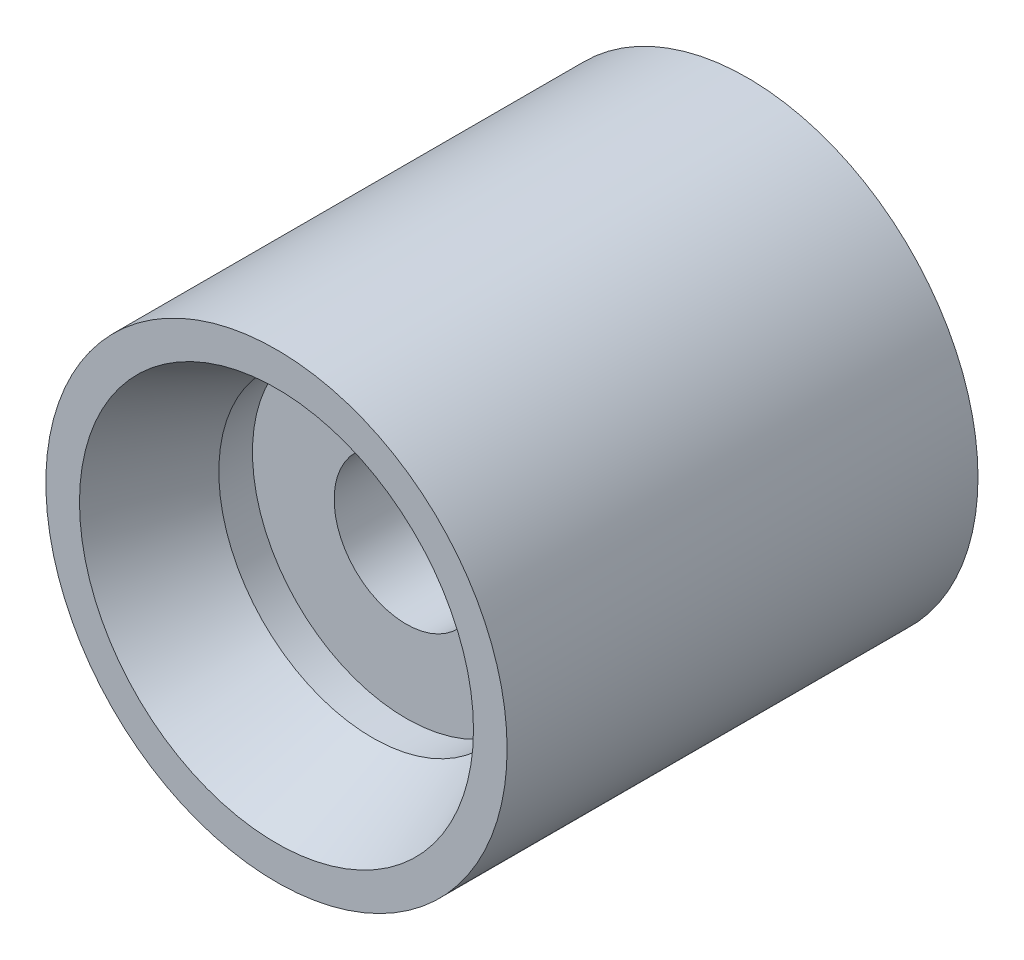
ISO-10303-21;
HEADER;
FILE_DESCRIPTION(('STEP AP214'),'2;1');
FILE_NAME('part.step','',(''),(''),'','','');
FILE_SCHEMA(('AUTOMOTIVE_DESIGN { 1 0 10303 214 1 1 1 1 }'));
ENDSEC;
DATA;
#1=APPLICATION_CONTEXT('core data for automotive mechanical design processes');
#2=APPLICATION_PROTOCOL_DEFINITION('international standard','automotive_design',2000,#1);
#3=PRODUCT_CONTEXT('',#1,'mechanical');
#4=PRODUCT('Part','Part','',(#3));
#5=PRODUCT_RELATED_PRODUCT_CATEGORY('part','',(#4));
#6=PRODUCT_DEFINITION_FORMATION('','',#4);
#7=PRODUCT_DEFINITION_CONTEXT('part definition',#1,'design');
#8=PRODUCT_DEFINITION('design','',#6,#7);
#9=PRODUCT_DEFINITION_SHAPE('','',#8);
#10=(LENGTH_UNIT() NAMED_UNIT(*) SI_UNIT(.MILLI.,.METRE.));
#11=(NAMED_UNIT(*) PLANE_ANGLE_UNIT() SI_UNIT($,.RADIAN.));
#12=(NAMED_UNIT(*) SI_UNIT($,.STERADIAN.) SOLID_ANGLE_UNIT());
#13=UNCERTAINTY_MEASURE_WITH_UNIT(LENGTH_MEASURE(1.E-05),#10,'distance_accuracy_value','');
#14=(GEOMETRIC_REPRESENTATION_CONTEXT(3) GLOBAL_UNCERTAINTY_ASSIGNED_CONTEXT((#13)) GLOBAL_UNIT_ASSIGNED_CONTEXT((#10,
#11,#12)) REPRESENTATION_CONTEXT('',''));
#15=CARTESIAN_POINT('',(0.,0.,0.));
#16=DIRECTION('',(0.,0.,1.));
#17=DIRECTION('',(1.,0.,0.));
#18=AXIS2_PLACEMENT_3D('',#15,#16,#17);
#19=CARTESIAN_POINT('',(0.,-30.,24.5));
#20=DIRECTION('',(0.,0.,1.));
#21=DIRECTION('',(-1.,0.,0.));
#22=AXIS2_PLACEMENT_3D('',#19,#20,#21);
#23=PLANE('',#22);
#24=CARTESIAN_POINT('',(0.,0.,24.5));
#25=DIRECTION('',(0.,0.,-1.));
#26=DIRECTION('',(1.,0.,0.));
#27=AXIS2_PLACEMENT_3D('',#24,#25,#26);
#28=CIRCLE('',#27,20.5);
#29=CARTESIAN_POINT('',(20.5,0.,24.5));
#30=VERTEX_POINT('',#29);
#31=EDGE_CURVE('E32',#30,#30,#28,.T.);
#32=ORIENTED_EDGE('',*,*,#31,.T.);
#33=EDGE_LOOP('',(#32));
#34=FACE_BOUND('',#33,.T.);
#35=CARTESIAN_POINT('',(0.,0.,24.5));
#36=DIRECTION('',(0.,0.,1.));
#37=DIRECTION('',(1.,0.,0.));
#38=AXIS2_PLACEMENT_3D('',#35,#36,#37);
#39=CIRCLE('',#38,24.);
#40=CARTESIAN_POINT('',(24.,0.,24.5));
#41=VERTEX_POINT('',#40);
#42=EDGE_CURVE('E45',#41,#41,#39,.T.);
#43=ORIENTED_EDGE('',*,*,#42,.T.);
#44=EDGE_LOOP('',(#43));
#45=FACE_BOUND('',#44,.T.);
#46=ADVANCED_FACE('F12',(#34,#45),#23,.T.);
#47=CARTESIAN_POINT('',(0.,-30.,-24.5));
#48=DIRECTION('',(0.,0.,1.));
#49=DIRECTION('',(-1.,0.,0.));
#50=AXIS2_PLACEMENT_3D('',#47,#48,#49);
#51=PLANE('',#50);
#52=CARTESIAN_POINT('',(0.,0.,-24.5));
#53=DIRECTION('',(0.,0.,-1.));
#54=DIRECTION('',(1.,0.,0.));
#55=AXIS2_PLACEMENT_3D('',#52,#53,#54);
#56=CIRCLE('',#55,20.5);
#57=CARTESIAN_POINT('',(20.5,0.,-24.5));
#58=VERTEX_POINT('',#57);
#59=EDGE_CURVE('E35',#58,#58,#56,.T.);
#60=ORIENTED_EDGE('',*,*,#59,.F.);
#61=EDGE_LOOP('',(#60));
#62=FACE_BOUND('',#61,.T.);
#63=CARTESIAN_POINT('',(0.,0.,-24.5));
#64=DIRECTION('',(0.,0.,1.));
#65=DIRECTION('',(1.,0.,0.));
#66=AXIS2_PLACEMENT_3D('',#63,#64,#65);
#67=CIRCLE('',#66,24.);
#68=CARTESIAN_POINT('',(24.,0.,-24.5));
#69=VERTEX_POINT('',#68);
#70=EDGE_CURVE('E44',#69,#69,#67,.T.);
#71=ORIENTED_EDGE('',*,*,#70,.F.);
#72=EDGE_LOOP('',(#71));
#73=FACE_BOUND('',#72,.T.);
#74=ADVANCED_FACE('F54',(#62,#73),#51,.F.);
#75=CARTESIAN_POINT('',(0.,-7.5,-11.));
#76=DIRECTION('',(0.,0.,-1.));
#77=DIRECTION('',(1.,0.,0.));
#78=AXIS2_PLACEMENT_3D('',#75,#76,#77);
#79=PLANE('',#78);
#80=CARTESIAN_POINT('',(0.,0.,-11.));
#81=DIRECTION('',(0.,0.,-1.));
#82=DIRECTION('',(1.,0.,0.));
#83=AXIS2_PLACEMENT_3D('',#80,#81,#82);
#84=CIRCLE('',#83,16.);
#85=CARTESIAN_POINT('',(16.,0.,-11.));
#86=VERTEX_POINT('',#85);
#87=EDGE_CURVE('E41',#86,#86,#84,.T.);
#88=ORIENTED_EDGE('',*,*,#87,.T.);
#89=EDGE_LOOP('',(#88));
#90=FACE_BOUND('',#89,.T.);
#91=CARTESIAN_POINT('',(0.,0.,-11.));
#92=DIRECTION('',(0.,0.,-1.));
#93=DIRECTION('',(1.,0.,0.));
#94=AXIS2_PLACEMENT_3D('',#91,#92,#93);
#95=CIRCLE('',#94,7.5);
#96=CARTESIAN_POINT('',(7.5,0.,-11.));
#97=VERTEX_POINT('',#96);
#98=EDGE_CURVE('E8',#97,#97,#95,.T.);
#99=ORIENTED_EDGE('',*,*,#98,.F.);
#100=EDGE_LOOP('',(#99));
#101=FACE_BOUND('',#100,.T.);
#102=ADVANCED_FACE('F14',(#90,#101),#79,.T.);
#103=CARTESIAN_POINT('',(0.,0.,-20.));
#104=DIRECTION('',(0.,0.,-1.));
#105=DIRECTION('',(1.,0.,0.));
#106=AXIS2_PLACEMENT_3D('',#103,#104,#105);
#107=CYLINDRICAL_SURFACE('',#106,7.5);
#108=ORIENTED_EDGE('',*,*,#98,.T.);
#109=EDGE_LOOP('',(#108));
#110=FACE_BOUND('',#109,.T.);
#111=CARTESIAN_POINT('',(0.,0.,11.));
#112=DIRECTION('',(0.,0.,-1.));
#113=DIRECTION('',(1.,0.,0.));
#114=AXIS2_PLACEMENT_3D('',#111,#112,#113);
#115=CIRCLE('',#114,7.5);
#116=CARTESIAN_POINT('',(7.5,0.,11.));
#117=VERTEX_POINT('',#116);
#118=EDGE_CURVE('E19',#117,#117,#115,.T.);
#119=ORIENTED_EDGE('',*,*,#118,.F.);
#120=EDGE_LOOP('',(#119));
#121=FACE_BOUND('',#120,.T.);
#122=ADVANCED_FACE('F64',(#110,#121),#107,.F.);
#123=CARTESIAN_POINT('',(0.,-7.5,11.));
#124=DIRECTION('',(0.,0.,-1.));
#125=DIRECTION('',(1.,0.,0.));
#126=AXIS2_PLACEMENT_3D('',#123,#124,#125);
#127=PLANE('',#126);
#128=CARTESIAN_POINT('',(0.,0.,11.));
#129=DIRECTION('',(0.,0.,-1.));
#130=DIRECTION('',(1.,0.,0.));
#131=AXIS2_PLACEMENT_3D('',#128,#129,#130);
#132=CIRCLE('',#131,16.);
#133=CARTESIAN_POINT('',(16.,0.,11.));
#134=VERTEX_POINT('',#133);
#135=EDGE_CURVE('E23',#134,#134,#132,.T.);
#136=ORIENTED_EDGE('',*,*,#135,.F.);
#137=EDGE_LOOP('',(#136));
#138=FACE_BOUND('',#137,.T.);
#139=ORIENTED_EDGE('',*,*,#118,.T.);
#140=EDGE_LOOP('',(#139));
#141=FACE_BOUND('',#140,.T.);
#142=ADVANCED_FACE('F80',(#138,#141),#127,.F.);
#143=CARTESIAN_POINT('',(0.,0.,-20.));
#144=DIRECTION('',(0.,0.,-1.));
#145=DIRECTION('',(1.,0.,0.));
#146=AXIS2_PLACEMENT_3D('',#143,#144,#145);
#147=CYLINDRICAL_SURFACE('',#146,16.);
#148=CARTESIAN_POINT('',(0.,0.,14.5));
#149=DIRECTION('',(0.,0.,-1.));
#150=DIRECTION('',(1.,0.,0.));
#151=AXIS2_PLACEMENT_3D('',#148,#149,#150);
#152=CIRCLE('',#151,16.);
#153=CARTESIAN_POINT('',(16.,0.,14.5));
#154=VERTEX_POINT('',#153);
#155=EDGE_CURVE('E27',#154,#154,#152,.T.);
#156=ORIENTED_EDGE('',*,*,#155,.F.);
#157=EDGE_LOOP('',(#156));
#158=FACE_BOUND('',#157,.T.);
#159=ORIENTED_EDGE('',*,*,#135,.T.);
#160=EDGE_LOOP('',(#159));
#161=FACE_BOUND('',#160,.T.);
#162=ADVANCED_FACE('F76',(#158,#161),#147,.F.);
#163=CARTESIAN_POINT('',(0.,0.,14.5));
#164=DIRECTION('',(0.,0.,1.));
#165=DIRECTION('',(-1.,0.,0.));
#166=AXIS2_PLACEMENT_3D('',#163,#164,#165);
#167=CONICAL_SURFACE('',#166,16.,0.42285392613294);
#168=ORIENTED_EDGE('',*,*,#31,.F.);
#169=EDGE_LOOP('',(#168));
#170=FACE_BOUND('',#169,.T.);
#171=ORIENTED_EDGE('',*,*,#155,.T.);
#172=EDGE_LOOP('',(#171));
#173=FACE_BOUND('',#172,.T.);
#174=ADVANCED_FACE('F73',(#170,#173),#167,.F.);
#175=CARTESIAN_POINT('',(0.,0.,-14.5));
#176=DIRECTION('',(0.,0.,-1.));
#177=DIRECTION('',(1.,0.,0.));
#178=AXIS2_PLACEMENT_3D('',#175,#176,#177);
#179=CONICAL_SURFACE('',#178,16.,0.42285392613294);
#180=ORIENTED_EDGE('',*,*,#59,.T.);
#181=EDGE_LOOP('',(#180));
#182=FACE_BOUND('',#181,.T.);
#183=CARTESIAN_POINT('',(0.,0.,-14.5));
#184=DIRECTION('',(0.,0.,-1.));
#185=DIRECTION('',(1.,0.,0.));
#186=AXIS2_PLACEMENT_3D('',#183,#184,#185);
#187=CIRCLE('',#186,16.);
#188=CARTESIAN_POINT('',(16.,0.,-14.5));
#189=VERTEX_POINT('',#188);
#190=EDGE_CURVE('E38',#189,#189,#187,.T.);
#191=ORIENTED_EDGE('',*,*,#190,.F.);
#192=EDGE_LOOP('',(#191));
#193=FACE_BOUND('',#192,.T.);
#194=ADVANCED_FACE('F70',(#182,#193),#179,.F.);
#195=CARTESIAN_POINT('',(0.,0.,-20.));
#196=DIRECTION('',(0.,0.,-1.));
#197=DIRECTION('',(1.,0.,0.));
#198=AXIS2_PLACEMENT_3D('',#195,#196,#197);
#199=CYLINDRICAL_SURFACE('',#198,16.);
#200=ORIENTED_EDGE('',*,*,#190,.T.);
#201=EDGE_LOOP('',(#200));
#202=FACE_BOUND('',#201,.T.);
#203=ORIENTED_EDGE('',*,*,#87,.F.);
#204=EDGE_LOOP('',(#203));
#205=FACE_BOUND('',#204,.T.);
#206=ADVANCED_FACE('F118',(#202,#205),#199,.F.);
#207=CARTESIAN_POINT('',(0.,0.,-24.5));
#208=DIRECTION('',(0.,0.,1.));
#209=DIRECTION('',(1.,0.,0.));
#210=AXIS2_PLACEMENT_3D('',#207,#208,#209);
#211=CYLINDRICAL_SURFACE('',#210,24.);
#212=ORIENTED_EDGE('',*,*,#70,.T.);
#213=EDGE_LOOP('',(#212));
#214=FACE_BOUND('',#213,.T.);
#215=ORIENTED_EDGE('',*,*,#42,.F.);
#216=EDGE_LOOP('',(#215));
#217=FACE_BOUND('',#216,.T.);
#218=ADVANCED_FACE('F51',(#214,#217),#211,.T.);
#219=CLOSED_SHELL('',(#46,#74,#102,#122,#142,#162,#174,#194,#206,#218));
#220=MANIFOLD_SOLID_BREP('B1',#219);
#221=ADVANCED_BREP_SHAPE_REPRESENTATION('',(#18,#220),#14);
#222=SHAPE_DEFINITION_REPRESENTATION(#9,#221);
ENDSEC;
END-ISO-10303-21;
